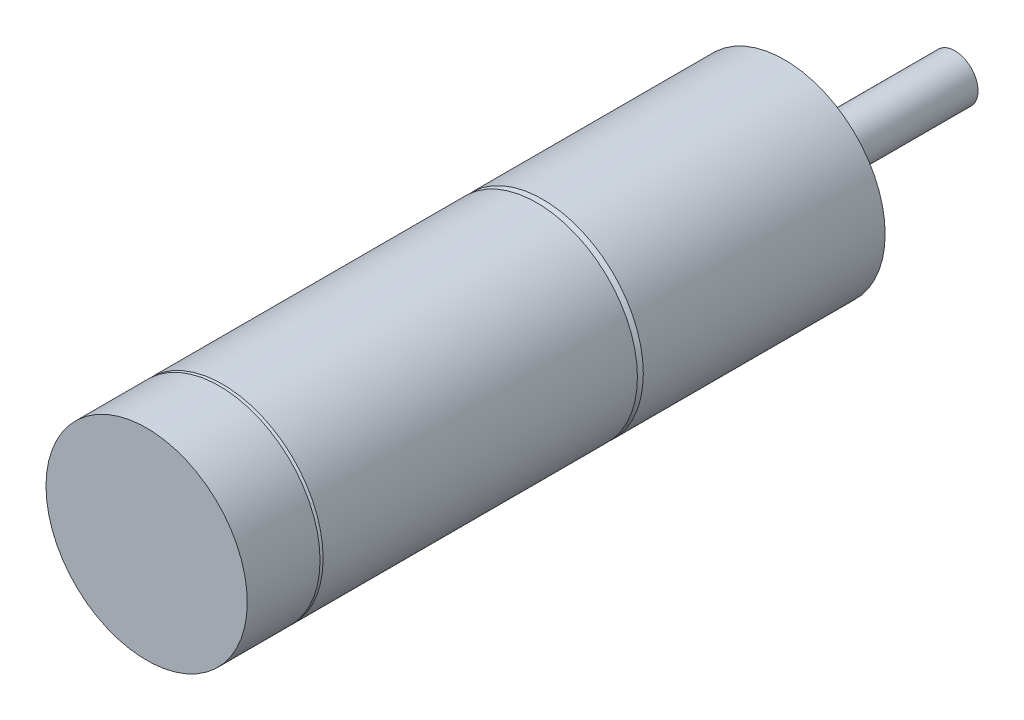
ISO-10303-21;
HEADER;
FILE_DESCRIPTION(('STEP AP214'),'2;1');
FILE_NAME('part.step','',(''),(''),'','','');
FILE_SCHEMA(('AUTOMOTIVE_DESIGN { 1 0 10303 214 1 1 1 1 }'));
ENDSEC;
DATA;
#1=APPLICATION_CONTEXT('core data for automotive mechanical design processes');
#2=APPLICATION_PROTOCOL_DEFINITION('international standard','automotive_design',2000,#1);
#3=PRODUCT_CONTEXT('',#1,'mechanical');
#4=PRODUCT('Part','Part','',(#3));
#5=PRODUCT_RELATED_PRODUCT_CATEGORY('part','',(#4));
#6=PRODUCT_DEFINITION_FORMATION('','',#4);
#7=PRODUCT_DEFINITION_CONTEXT('part definition',#1,'design');
#8=PRODUCT_DEFINITION('design','',#6,#7);
#9=PRODUCT_DEFINITION_SHAPE('','',#8);
#10=(LENGTH_UNIT() NAMED_UNIT(*) SI_UNIT(.MILLI.,.METRE.));
#11=(NAMED_UNIT(*) PLANE_ANGLE_UNIT() SI_UNIT($,.RADIAN.));
#12=(NAMED_UNIT(*) SI_UNIT($,.STERADIAN.) SOLID_ANGLE_UNIT());
#13=UNCERTAINTY_MEASURE_WITH_UNIT(LENGTH_MEASURE(1.E-05),#10,'distance_accuracy_value','');
#14=(GEOMETRIC_REPRESENTATION_CONTEXT(3) GLOBAL_UNCERTAINTY_ASSIGNED_CONTEXT((#13)) GLOBAL_UNIT_ASSIGNED_CONTEXT((#10,
#11,#12)) REPRESENTATION_CONTEXT('',''));
#15=CARTESIAN_POINT('',(0.,0.,0.));
#16=DIRECTION('',(0.,0.,1.));
#17=DIRECTION('',(1.,0.,0.));
#18=AXIS2_PLACEMENT_3D('',#15,#16,#17);
#19=CARTESIAN_POINT('',(0.,0.,-2.6));
#20=DIRECTION('',(0.,0.,-1.));
#21=DIRECTION('',(-1.,0.,0.));
#22=AXIS2_PLACEMENT_3D('',#19,#20,#21);
#23=PLANE('',#22);
#24=CARTESIAN_POINT('',(0.,0.,-2.6));
#25=DIRECTION('',(0.,0.,-1.));
#26=DIRECTION('',(-1.,0.,0.));
#27=AXIS2_PLACEMENT_3D('',#24,#25,#26);
#28=CIRCLE('',#27,2.5);
#29=CARTESIAN_POINT('',(-2.49999999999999,0.,-2.6));
#30=VERTEX_POINT('',#29);
#31=EDGE_CURVE('E96',#30,#30,#28,.T.);
#32=ORIENTED_EDGE('',*,*,#31,.T.);
#33=EDGE_LOOP('',(#32));
#34=FACE_BOUND('',#33,.T.);
#35=CARTESIAN_POINT('',(0.,0.,-2.6));
#36=DIRECTION('',(0.,0.,-1.));
#37=DIRECTION('',(-1.,0.,0.));
#38=AXIS2_PLACEMENT_3D('',#35,#36,#37);
#39=CIRCLE('',#38,1.5);
#40=CARTESIAN_POINT('',(-1.49999999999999,0.,-2.6));
#41=VERTEX_POINT('',#40);
#42=EDGE_CURVE('E95',#41,#41,#39,.F.);
#43=ORIENTED_EDGE('',*,*,#42,.T.);
#44=EDGE_LOOP('',(#43));
#45=FACE_BOUND('',#44,.T.);
#46=ADVANCED_FACE('F41',(#34,#45),#23,.T.);
#47=CARTESIAN_POINT('',(0.,0.,-1.));
#48=DIRECTION('',(0.,0.,-1.));
#49=DIRECTION('',(-1.,0.,0.));
#50=AXIS2_PLACEMENT_3D('',#47,#48,#49);
#51=PLANE('',#50);
#52=CARTESIAN_POINT('',(0.,0.,-1.));
#53=DIRECTION('',(0.,0.,-1.));
#54=DIRECTION('',(-1.,0.,0.));
#55=AXIS2_PLACEMENT_3D('',#52,#53,#54);
#56=CIRCLE('',#55,3.);
#57=CARTESIAN_POINT('',(-2.99999999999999,0.,-1.));
#58=VERTEX_POINT('',#57);
#59=EDGE_CURVE('E99',#58,#58,#56,.T.);
#60=ORIENTED_EDGE('',*,*,#59,.T.);
#61=EDGE_LOOP('',(#60));
#62=FACE_BOUND('',#61,.T.);
#63=CARTESIAN_POINT('',(0.,0.,-1.));
#64=DIRECTION('',(0.,0.,-1.));
#65=DIRECTION('',(-1.,0.,0.));
#66=AXIS2_PLACEMENT_3D('',#63,#64,#65);
#67=CIRCLE('',#66,2.5);
#68=CARTESIAN_POINT('',(-2.49999999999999,0.,-1.));
#69=VERTEX_POINT('',#68);
#70=EDGE_CURVE('E100',#69,#69,#67,.T.);
#71=ORIENTED_EDGE('',*,*,#70,.F.);
#72=EDGE_LOOP('',(#71));
#73=FACE_BOUND('',#72,.T.);
#74=ADVANCED_FACE('F147',(#62,#73),#51,.T.);
#75=CARTESIAN_POINT('',(0.,0.,0.));
#76=DIRECTION('',(0.,0.,1.));
#77=DIRECTION('',(1.,0.,0.));
#78=AXIS2_PLACEMENT_3D('',#75,#76,#77);
#79=PLANE('',#78);
#80=CARTESIAN_POINT('',(3.68698048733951,2.99477459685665,0.));
#81=DIRECTION('',(0.,0.,-1.));
#82=DIRECTION('',(1.,0.,0.));
#83=AXIS2_PLACEMENT_3D('',#80,#81,#82);
#84=CIRCLE('',#83,0.999999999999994);
#85=CARTESIAN_POINT('',(4.6869804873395,2.99477459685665,0.));
#86=VERTEX_POINT('',#85);
#87=EDGE_CURVE('E333',#86,#86,#84,.T.);
#88=ORIENTED_EDGE('',*,*,#87,.F.);
#89=EDGE_LOOP('',(#88));
#90=FACE_BOUND('',#89,.T.);
#91=CARTESIAN_POINT('',(-3.68698048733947,-2.99477459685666,0.));
#92=DIRECTION('',(0.,0.,-1.));
#93=DIRECTION('',(-1.,0.,0.));
#94=AXIS2_PLACEMENT_3D('',#91,#92,#93);
#95=CIRCLE('',#94,0.999999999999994);
#96=CARTESIAN_POINT('',(-4.68698048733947,-2.99477459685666,0.));
#97=VERTEX_POINT('',#96);
#98=EDGE_CURVE('E66',#97,#97,#95,.T.);
#99=ORIENTED_EDGE('',*,*,#98,.F.);
#100=EDGE_LOOP('',(#99));
#101=FACE_BOUND('',#100,.T.);
#102=CARTESIAN_POINT('',(0.,0.,0.));
#103=DIRECTION('',(0.,0.,1.));
#104=DIRECTION('',(1.,0.,0.));
#105=AXIS2_PLACEMENT_3D('',#102,#103,#104);
#106=CIRCLE('',#105,6.5);
#107=CARTESIAN_POINT('',(6.50000000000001,0.,0.));
#108=VERTEX_POINT('',#107);
#109=EDGE_CURVE('E109',#108,#108,#106,.T.);
#110=ORIENTED_EDGE('',*,*,#109,.F.);
#111=EDGE_LOOP('',(#110));
#112=FACE_BOUND('',#111,.T.);
#113=CARTESIAN_POINT('',(0.,0.,0.));
#114=DIRECTION('',(0.,0.,1.));
#115=DIRECTION('',(1.,0.,0.));
#116=AXIS2_PLACEMENT_3D('',#113,#114,#115);
#117=CIRCLE('',#116,3.);
#118=CARTESIAN_POINT('',(3.00000000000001,0.,0.));
#119=VERTEX_POINT('',#118);
#120=EDGE_CURVE('E120',#119,#119,#117,.F.);
#121=ORIENTED_EDGE('',*,*,#120,.F.);
#122=EDGE_LOOP('',(#121));
#123=FACE_BOUND('',#122,.T.);
#124=ADVANCED_FACE('F153',(#90,#101,#112,#123),#79,.F.);
#125=CARTESIAN_POINT('',(0.,0.,16.));
#126=DIRECTION('',(0.,0.,-1.));
#127=DIRECTION('',(-1.,0.,0.));
#128=AXIS2_PLACEMENT_3D('',#125,#126,#127);
#129=CYLINDRICAL_SURFACE('',#128,6.5);
#130=CARTESIAN_POINT('',(0.,0.,15.619));
#131=DIRECTION('',(0.,0.,1.));
#132=DIRECTION('',(1.,0.,0.));
#133=AXIS2_PLACEMENT_3D('',#130,#131,#132);
#134=CIRCLE('',#133,6.5);
#135=CARTESIAN_POINT('',(6.5,0.,15.619));
#136=VERTEX_POINT('',#135);
#137=EDGE_CURVE('E116',#136,#136,#134,.F.);
#138=ORIENTED_EDGE('',*,*,#137,.T.);
#139=EDGE_LOOP('',(#138));
#140=FACE_BOUND('',#139,.T.);
#141=ORIENTED_EDGE('',*,*,#109,.T.);
#142=EDGE_LOOP('',(#141));
#143=FACE_BOUND('',#142,.T.);
#144=ADVANCED_FACE('F178',(#140,#143),#129,.T.);
#145=CARTESIAN_POINT('',(0.,0.,16.));
#146=DIRECTION('',(0.,0.,-1.));
#147=DIRECTION('',(-1.,0.,0.));
#148=AXIS2_PLACEMENT_3D('',#145,#146,#147);
#149=CONICAL_SURFACE('',#148,6.119,0.785398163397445);
#150=ORIENTED_EDGE('',*,*,#137,.F.);
#151=EDGE_LOOP('',(#150));
#152=FACE_BOUND('',#151,.T.);
#153=CARTESIAN_POINT('',(0.,0.,16.));
#154=DIRECTION('',(0.,0.,1.));
#155=DIRECTION('',(1.,0.,0.));
#156=AXIS2_PLACEMENT_3D('',#153,#154,#155);
#157=CIRCLE('',#156,6.119);
#158=CARTESIAN_POINT('',(6.119,0.,16.));
#159=VERTEX_POINT('',#158);
#160=EDGE_CURVE('E112',#159,#159,#157,.T.);
#161=ORIENTED_EDGE('',*,*,#160,.F.);
#162=EDGE_LOOP('',(#161));
#163=FACE_BOUND('',#162,.T.);
#164=ADVANCED_FACE('F174',(#152,#163),#149,.T.);
#165=CARTESIAN_POINT('',(0.,0.,36.5));
#166=DIRECTION('',(0.,0.,-1.));
#167=DIRECTION('',(-1.,0.,0.));
#168=AXIS2_PLACEMENT_3D('',#165,#166,#167);
#169=CYLINDRICAL_SURFACE('',#168,6.5);
#170=CARTESIAN_POINT('',(0.,0.,36.3));
#171=DIRECTION('',(0.,0.,1.));
#172=DIRECTION('',(1.,0.,0.));
#173=AXIS2_PLACEMENT_3D('',#170,#171,#172);
#174=CIRCLE('',#173,6.5);
#175=CARTESIAN_POINT('',(6.50000000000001,0.,36.3));
#176=VERTEX_POINT('',#175);
#177=EDGE_CURVE('E11',#176,#176,#174,.F.);
#178=ORIENTED_EDGE('',*,*,#177,.T.);
#179=EDGE_LOOP('',(#178));
#180=FACE_BOUND('',#179,.T.);
#181=CARTESIAN_POINT('',(0.,0.,16.));
#182=DIRECTION('',(0.,0.,1.));
#183=DIRECTION('',(1.,0.,0.));
#184=AXIS2_PLACEMENT_3D('',#181,#182,#183);
#185=CIRCLE('',#184,6.5);
#186=CARTESIAN_POINT('',(6.5,0.,16.));
#187=VERTEX_POINT('',#186);
#188=EDGE_CURVE('E105',#187,#187,#185,.T.);
#189=ORIENTED_EDGE('',*,*,#188,.T.);
#190=EDGE_LOOP('',(#189));
#191=FACE_BOUND('',#190,.T.);
#192=ADVANCED_FACE('F170',(#180,#191),#169,.T.);
#193=CARTESIAN_POINT('',(0.,0.,16.));
#194=DIRECTION('',(0.,0.,1.));
#195=DIRECTION('',(1.,0.,0.));
#196=AXIS2_PLACEMENT_3D('',#193,#194,#195);
#197=PLANE('',#196);
#198=ORIENTED_EDGE('',*,*,#160,.T.);
#199=EDGE_LOOP('',(#198));
#200=FACE_BOUND('',#199,.T.);
#201=ORIENTED_EDGE('',*,*,#188,.F.);
#202=EDGE_LOOP('',(#201));
#203=FACE_BOUND('',#202,.T.);
#204=ADVANCED_FACE('F166',(#200,#203),#197,.F.);
#205=CARTESIAN_POINT('',(0.,0.,-1.));
#206=DIRECTION('',(0.,0.,1.));
#207=DIRECTION('',(1.,0.,0.));
#208=AXIS2_PLACEMENT_3D('',#205,#206,#207);
#209=CYLINDRICAL_SURFACE('',#208,3.);
#210=ORIENTED_EDGE('',*,*,#59,.F.);
#211=EDGE_LOOP('',(#210));
#212=FACE_BOUND('',#211,.T.);
#213=ORIENTED_EDGE('',*,*,#120,.T.);
#214=EDGE_LOOP('',(#213));
#215=FACE_BOUND('',#214,.T.);
#216=ADVANCED_FACE('F161',(#212,#215),#209,.T.);
#217=CARTESIAN_POINT('',(0.,0.,-2.6));
#218=DIRECTION('',(0.,0.,1.));
#219=DIRECTION('',(1.,0.,0.));
#220=AXIS2_PLACEMENT_3D('',#217,#218,#219);
#221=CYLINDRICAL_SURFACE('',#220,2.5);
#222=ORIENTED_EDGE('',*,*,#31,.F.);
#223=EDGE_LOOP('',(#222));
#224=FACE_BOUND('',#223,.T.);
#225=ORIENTED_EDGE('',*,*,#70,.T.);
#226=EDGE_LOOP('',(#225));
#227=FACE_BOUND('',#226,.T.);
#228=ADVANCED_FACE('F159',(#224,#227),#221,.T.);
#229=CARTESIAN_POINT('',(0.,0.,-11.));
#230=DIRECTION('',(0.,0.,1.));
#231=DIRECTION('',(1.,0.,0.));
#232=AXIS2_PLACEMENT_3D('',#229,#230,#231);
#233=CYLINDRICAL_SURFACE('',#232,1.5);
#234=ORIENTED_EDGE('',*,*,#42,.F.);
#235=EDGE_LOOP('',(#234));
#236=FACE_BOUND('',#235,.T.);
#237=CARTESIAN_POINT('',(0.,0.,-11.));
#238=DIRECTION('',(0.,0.,-1.));
#239=DIRECTION('',(-1.,0.,0.));
#240=AXIS2_PLACEMENT_3D('',#237,#238,#239);
#241=CIRCLE('',#240,1.5);
#242=CARTESIAN_POINT('',(-1.50000000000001,0.,-11.));
#243=VERTEX_POINT('',#242);
#244=EDGE_CURVE('E89',#243,#243,#241,.T.);
#245=ORIENTED_EDGE('',*,*,#244,.F.);
#246=EDGE_LOOP('',(#245));
#247=FACE_BOUND('',#246,.T.);
#248=ADVANCED_FACE('F142',(#236,#247),#233,.T.);
#249=CARTESIAN_POINT('',(0.,0.,-11.));
#250=DIRECTION('',(0.,0.,-1.));
#251=DIRECTION('',(-1.,0.,0.));
#252=AXIS2_PLACEMENT_3D('',#249,#250,#251);
#253=PLANE('',#252);
#254=ORIENTED_EDGE('',*,*,#244,.T.);
#255=EDGE_LOOP('',(#254));
#256=FACE_BOUND('',#255,.T.);
#257=ADVANCED_FACE('F133',(#256),#253,.T.);
#258=CARTESIAN_POINT('',(0.,0.,36.5));
#259=DIRECTION('',(0.,0.,-1.));
#260=DIRECTION('',(-1.,0.,0.));
#261=AXIS2_PLACEMENT_3D('',#258,#259,#260);
#262=CONICAL_SURFACE('',#261,6.3,0.785398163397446);
#263=ORIENTED_EDGE('',*,*,#177,.F.);
#264=EDGE_LOOP('',(#263));
#265=FACE_BOUND('',#264,.T.);
#266=CARTESIAN_POINT('',(0.,0.,36.5));
#267=DIRECTION('',(0.,0.,1.));
#268=DIRECTION('',(1.,0.,0.));
#269=AXIS2_PLACEMENT_3D('',#266,#267,#268);
#270=CIRCLE('',#269,6.3);
#271=CARTESIAN_POINT('',(6.30000000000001,0.,36.5));
#272=VERTEX_POINT('',#271);
#273=EDGE_CURVE('E50',#272,#272,#270,.T.);
#274=ORIENTED_EDGE('',*,*,#273,.F.);
#275=EDGE_LOOP('',(#274));
#276=FACE_BOUND('',#275,.T.);
#277=ADVANCED_FACE('F43',(#265,#276),#262,.T.);
#278=CARTESIAN_POINT('',(0.,0.,41.2));
#279=DIRECTION('',(0.,0.,-1.));
#280=DIRECTION('',(-1.,0.,0.));
#281=AXIS2_PLACEMENT_3D('',#278,#279,#280);
#282=CYLINDRICAL_SURFACE('',#281,6.5);
#283=CARTESIAN_POINT('',(0.,0.,41.2));
#284=DIRECTION('',(0.,0.,1.));
#285=DIRECTION('',(1.,0.,0.));
#286=AXIS2_PLACEMENT_3D('',#283,#284,#285);
#287=CIRCLE('',#286,6.5);
#288=CARTESIAN_POINT('',(6.50000000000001,0.,41.2));
#289=VERTEX_POINT('',#288);
#290=EDGE_CURVE('E86',#289,#289,#287,.T.);
#291=ORIENTED_EDGE('',*,*,#290,.F.);
#292=EDGE_LOOP('',(#291));
#293=FACE_BOUND('',#292,.T.);
#294=CARTESIAN_POINT('',(0.,0.,36.5));
#295=DIRECTION('',(0.,0.,1.));
#296=DIRECTION('',(1.,0.,0.));
#297=AXIS2_PLACEMENT_3D('',#294,#295,#296);
#298=CIRCLE('',#297,6.5);
#299=CARTESIAN_POINT('',(6.50000000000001,0.,36.5));
#300=VERTEX_POINT('',#299);
#301=EDGE_CURVE('E85',#300,#300,#298,.T.);
#302=ORIENTED_EDGE('',*,*,#301,.T.);
#303=EDGE_LOOP('',(#302));
#304=FACE_BOUND('',#303,.T.);
#305=ADVANCED_FACE('F132',(#293,#304),#282,.T.);
#306=CARTESIAN_POINT('',(0.,0.,41.2));
#307=DIRECTION('',(0.,0.,1.));
#308=DIRECTION('',(1.,0.,0.));
#309=AXIS2_PLACEMENT_3D('',#306,#307,#308);
#310=PLANE('',#309);
#311=ORIENTED_EDGE('',*,*,#290,.T.);
#312=EDGE_LOOP('',(#311));
#313=FACE_BOUND('',#312,.T.);
#314=ADVANCED_FACE('F139',(#313),#310,.T.);
#315=CARTESIAN_POINT('',(0.,0.,36.5));
#316=DIRECTION('',(0.,0.,1.));
#317=DIRECTION('',(1.,0.,0.));
#318=AXIS2_PLACEMENT_3D('',#315,#316,#317);
#319=PLANE('',#318);
#320=ORIENTED_EDGE('',*,*,#273,.T.);
#321=EDGE_LOOP('',(#320));
#322=FACE_BOUND('',#321,.T.);
#323=ORIENTED_EDGE('',*,*,#301,.F.);
#324=EDGE_LOOP('',(#323));
#325=FACE_BOUND('',#324,.T.);
#326=ADVANCED_FACE('F128',(#322,#325),#319,.F.);
#327=CARTESIAN_POINT('',(-3.68698048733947,-2.99477459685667,5.));
#328=DIRECTION('',(0.,0.,-1.));
#329=DIRECTION('',(-1.,0.,0.));
#330=AXIS2_PLACEMENT_3D('',#327,#328,#329);
#331=CONICAL_SURFACE('',#330,0.799999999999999,1.02974425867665);
#332=CARTESIAN_POINT('',(-3.68698048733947,-2.99477459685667,5.48068849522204));
#333=VERTEX_POINT('',#332);
#334=VERTEX_LOOP('',#333);
#335=FACE_BOUND('',#334,.T.);
#336=CARTESIAN_POINT('',(-3.68698048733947,-2.99477459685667,5.));
#337=DIRECTION('',(0.,0.,-1.));
#338=DIRECTION('',(-1.,0.,0.));
#339=AXIS2_PLACEMENT_3D('',#336,#337,#338);
#340=CIRCLE('',#339,0.799999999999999);
#341=CARTESIAN_POINT('',(-4.48698048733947,-2.99477459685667,5.));
#342=VERTEX_POINT('',#341);
#343=EDGE_CURVE('E82',#342,#342,#340,.T.);
#344=ORIENTED_EDGE('',*,*,#343,.T.);
#345=EDGE_LOOP('',(#344));
#346=FACE_BOUND('',#345,.T.);
#347=ADVANCED_FACE('F253',(#335,#346),#331,.F.);
#348=CARTESIAN_POINT('',(-3.68698048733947,-2.99477459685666,0.));
#349=DIRECTION('',(0.,0.,-1.));
#350=DIRECTION('',(-1.,0.,0.));
#351=AXIS2_PLACEMENT_3D('',#348,#349,#350);
#352=CYLINDRICAL_SURFACE('',#351,0.799999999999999);
#353=ORIENTED_EDGE('',*,*,#343,.F.);
#354=EDGE_LOOP('',(#353));
#355=FACE_BOUND('',#354,.T.);
#356=CARTESIAN_POINT('',(-3.68698048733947,-2.99477459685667,4.));
#357=DIRECTION('',(0.,0.,-1.));
#358=DIRECTION('',(-1.,0.,0.));
#359=AXIS2_PLACEMENT_3D('',#356,#357,#358);
#360=CIRCLE('',#359,0.799999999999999);
#361=CARTESIAN_POINT('',(-4.48698048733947,-2.99477459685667,4.));
#362=VERTEX_POINT('',#361);
#363=EDGE_CURVE('E79',#362,#362,#360,.T.);
#364=ORIENTED_EDGE('',*,*,#363,.T.);
#365=EDGE_LOOP('',(#364));
#366=FACE_BOUND('',#365,.T.);
#367=ADVANCED_FACE('F262',(#355,#366),#352,.F.);
#368=CARTESIAN_POINT('',(-2.88698048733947,-2.99477459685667,4.));
#369=DIRECTION('',(0.,0.,1.));
#370=DIRECTION('',(1.,0.,0.));
#371=AXIS2_PLACEMENT_3D('',#368,#369,#370);
#372=PLANE('',#371);
#373=ORIENTED_EDGE('',*,*,#363,.F.);
#374=EDGE_LOOP('',(#373));
#375=FACE_BOUND('',#374,.T.);
#376=CARTESIAN_POINT('',(-3.68698048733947,-2.99477459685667,4.));
#377=DIRECTION('',(0.,0.,-1.));
#378=DIRECTION('',(-1.,0.,0.));
#379=AXIS2_PLACEMENT_3D('',#376,#377,#378);
#380=CIRCLE('',#379,0.999999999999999);
#381=CARTESIAN_POINT('',(-4.68698048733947,-2.99477459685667,4.));
#382=VERTEX_POINT('',#381);
#383=EDGE_CURVE('E70',#382,#382,#380,.T.);
#384=ORIENTED_EDGE('',*,*,#383,.T.);
#385=EDGE_LOOP('',(#384));
#386=FACE_BOUND('',#385,.T.);
#387=ADVANCED_FACE('F271',(#375,#386),#372,.F.);
#388=CARTESIAN_POINT('',(-3.68698048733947,-2.99477459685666,0.));
#389=DIRECTION('',(0.,0.,-1.));
#390=DIRECTION('',(-1.,0.,0.));
#391=AXIS2_PLACEMENT_3D('',#388,#389,#390);
#392=CYLINDRICAL_SURFACE('',#391,0.999999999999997);
#393=ORIENTED_EDGE('',*,*,#383,.F.);
#394=EDGE_LOOP('',(#393));
#395=FACE_BOUND('',#394,.T.);
#396=ORIENTED_EDGE('',*,*,#98,.T.);
#397=EDGE_LOOP('',(#396));
#398=FACE_BOUND('',#397,.T.);
#399=ADVANCED_FACE('F60',(#395,#398),#392,.F.);
#400=CARTESIAN_POINT('',(3.68698048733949,2.99477459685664,5.));
#401=DIRECTION('',(0.,0.,-1.));
#402=DIRECTION('',(1.,0.,0.));
#403=AXIS2_PLACEMENT_3D('',#400,#401,#402);
#404=CONICAL_SURFACE('',#403,0.799999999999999,1.02974425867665);
#405=CARTESIAN_POINT('',(3.68698048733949,2.99477459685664,5.48068849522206));
#406=VERTEX_POINT('',#405);
#407=VERTEX_LOOP('',#406);
#408=FACE_BOUND('',#407,.T.);
#409=CARTESIAN_POINT('',(3.68698048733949,2.99477459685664,5.));
#410=DIRECTION('',(0.,0.,-1.));
#411=DIRECTION('',(1.,0.,0.));
#412=AXIS2_PLACEMENT_3D('',#409,#410,#411);
#413=CIRCLE('',#412,0.799999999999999);
#414=CARTESIAN_POINT('',(4.48698048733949,2.99477459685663,5.));
#415=VERTEX_POINT('',#414);
#416=EDGE_CURVE('E64',#415,#415,#413,.T.);
#417=ORIENTED_EDGE('',*,*,#416,.T.);
#418=EDGE_LOOP('',(#417));
#419=FACE_BOUND('',#418,.T.);
#420=ADVANCED_FACE('F56',(#408,#419),#404,.F.);
#421=CARTESIAN_POINT('',(3.68698048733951,2.99477459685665,0.));
#422=DIRECTION('',(0.,0.,-1.));
#423=DIRECTION('',(1.,0.,0.));
#424=AXIS2_PLACEMENT_3D('',#421,#422,#423);
#425=CYLINDRICAL_SURFACE('',#424,0.799999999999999);
#426=ORIENTED_EDGE('',*,*,#416,.F.);
#427=EDGE_LOOP('',(#426));
#428=FACE_BOUND('',#427,.T.);
#429=CARTESIAN_POINT('',(3.68698048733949,2.99477459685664,4.));
#430=DIRECTION('',(0.,0.,-1.));
#431=DIRECTION('',(1.,0.,0.));
#432=AXIS2_PLACEMENT_3D('',#429,#430,#431);
#433=CIRCLE('',#432,0.799999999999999);
#434=CARTESIAN_POINT('',(4.48698048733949,2.99477459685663,4.));
#435=VERTEX_POINT('',#434);
#436=EDGE_CURVE('E67',#435,#435,#433,.T.);
#437=ORIENTED_EDGE('',*,*,#436,.T.);
#438=EDGE_LOOP('',(#437));
#439=FACE_BOUND('',#438,.T.);
#440=ADVANCED_FACE('F59',(#428,#439),#425,.F.);
#441=CARTESIAN_POINT('',(2.8869804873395,2.99477459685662,4.));
#442=DIRECTION('',(0.,0.,1.));
#443=DIRECTION('',(-1.,0.,0.));
#444=AXIS2_PLACEMENT_3D('',#441,#442,#443);
#445=PLANE('',#444);
#446=ORIENTED_EDGE('',*,*,#436,.F.);
#447=EDGE_LOOP('',(#446));
#448=FACE_BOUND('',#447,.T.);
#449=CARTESIAN_POINT('',(3.68698048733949,2.99477459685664,4.));
#450=DIRECTION('',(0.,0.,-1.));
#451=DIRECTION('',(1.,0.,0.));
#452=AXIS2_PLACEMENT_3D('',#449,#450,#451);
#453=CIRCLE('',#452,0.999999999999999);
#454=CARTESIAN_POINT('',(4.68698048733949,2.99477459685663,4.));
#455=VERTEX_POINT('',#454);
#456=EDGE_CURVE('E73',#455,#455,#453,.T.);
#457=ORIENTED_EDGE('',*,*,#456,.T.);
#458=EDGE_LOOP('',(#457));
#459=FACE_BOUND('',#458,.T.);
#460=ADVANCED_FACE('F306',(#448,#459),#445,.F.);
#461=CARTESIAN_POINT('',(3.68698048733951,2.99477459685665,0.));
#462=DIRECTION('',(0.,0.,-1.));
#463=DIRECTION('',(1.,0.,0.));
#464=AXIS2_PLACEMENT_3D('',#461,#462,#463);
#465=CYLINDRICAL_SURFACE('',#464,0.999999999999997);
#466=ORIENTED_EDGE('',*,*,#456,.F.);
#467=EDGE_LOOP('',(#466));
#468=FACE_BOUND('',#467,.T.);
#469=ORIENTED_EDGE('',*,*,#87,.T.);
#470=EDGE_LOOP('',(#469));
#471=FACE_BOUND('',#470,.T.);
#472=ADVANCED_FACE('F292',(#468,#471),#465,.F.);
#473=CLOSED_SHELL('',(#46,#74,#124,#144,#164,#192,#204,#216,#228,#248,#257,#277,#305,#314,#326,
#347,#367,#387,#399,#420,#440,#460,#472));
#474=MANIFOLD_SOLID_BREP('B2',#473);
#475=ADVANCED_BREP_SHAPE_REPRESENTATION('',(#18,#474),#14);
#476=SHAPE_DEFINITION_REPRESENTATION(#9,#475);
ENDSEC;
END-ISO-10303-21;
